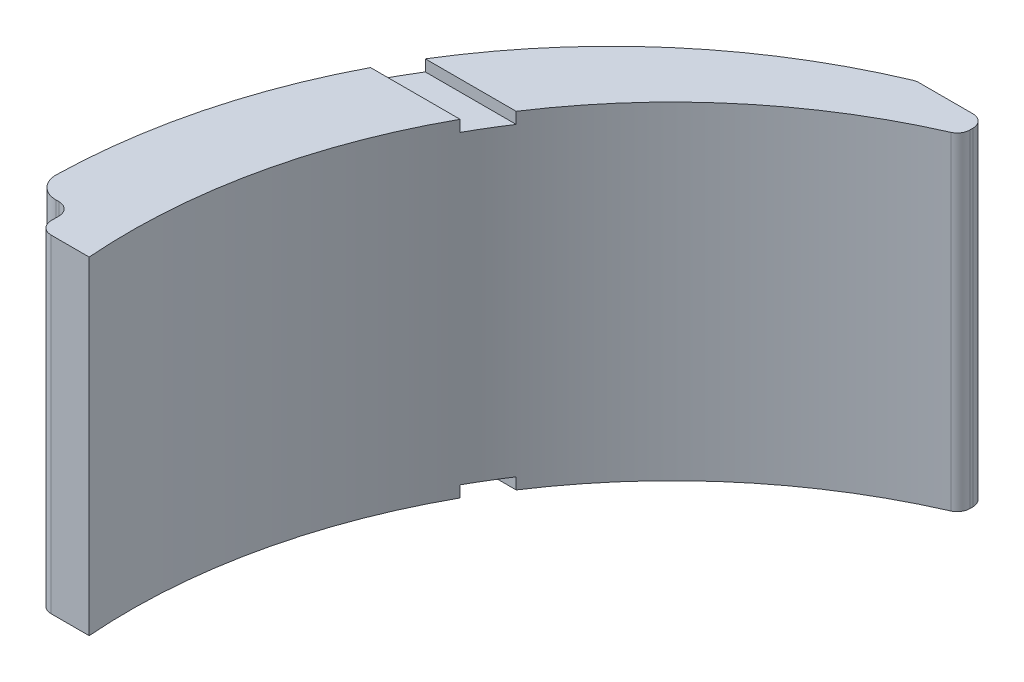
from build123d import *

# Parameters (mm, degrees)
BOSS_EXTRUDE1_DEPTH = 13
CUT_EXTRUDE3_DEPTH  = 0.45


with BuildPart() as part:
    # Sketch1 → Boss-Extrude1 (new body)
    with BuildSketch(Plane(origin=(0, 0, 0), x_dir=(1, 0, 0), z_dir=(0, 1, 0))):
        with BuildLine():
            Line((127.978811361, 161.287304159), (130.122404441, 161.287304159))
            ThreePointArc((130.122404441, 161.287304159), (130.475957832, 161.14085755), (130.622404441, 160.787304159))
            Line((130.622404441, 160.787304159), (130.622404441, 160.670064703))
            ThreePointArc((130.622404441, 160.670064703), (130.54101428, 160.396631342), (130.32334123, 160.212217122))
            ThreePointArc((130.32334123, 160.212217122), (120.519543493, 151.573116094), (117.528724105, 138.852914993))
            Line((117.528724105, 138.852914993), (116.023430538, 138.852914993))
            ThreePointArc((116.023430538, 138.852914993), (115.669877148, 138.999361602), (115.523430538, 139.352914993))
            Line((115.523430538, 139.352914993), (115.523430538, 139.656539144))
            ThreePointArc((115.523430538, 139.656539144), (115.376983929, 140.010092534), (115.023430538, 140.156539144))
            Line((115.023430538, 140.156539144), (114.903288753, 140.156539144))
            ThreePointArc((114.903288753, 140.156539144), (114.295597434, 140.412223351), (114.053499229, 141.025453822))
            ThreePointArc((114.053499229, 141.025453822), (117.933248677, 153.163747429), (127.784058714, 161.247816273))
            ThreePointArc((127.784058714, 161.247816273), (127.879453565, 161.277332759), (127.978811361, 161.287304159))
        make_face()
    extrude(amount=BOSS_EXTRUDE1_DEPTH)

    # Sketch8 → Cut-Extrude3 (cut)
    with BuildSketch(Plane(origin=(0, 0, 0), x_dir=(1, 0, 0), z_dir=(0, 1, 0))):
        with BuildLine():
            Line((117.387322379, 152.319736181), (120.987839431, 152.319736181))
            ThreePointArc((120.987839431, 152.319736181), (120.556502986, 151.634583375), (120.151268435, 150.933676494))
            Line((120.151268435, 150.933676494), (116.600379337, 150.933676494))
            ThreePointArc((116.600379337, 150.933676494), (116.981573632, 151.6336768), (117.387322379, 152.319736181))
        make_face()
    cut_extrude3 = extrude(amount=CUT_EXTRUDE3_DEPTH, mode=Mode.SUBTRACT)

    # Mirror1: Cut-Extrude3 across plane
    add(cut_extrude3.mirror(Plane(origin=(0, 6.5, 0), x_dir=(0, 0, 1), z_dir=(0, -1, 0))), mode=Mode.SUBTRACT)


solid = part.part
